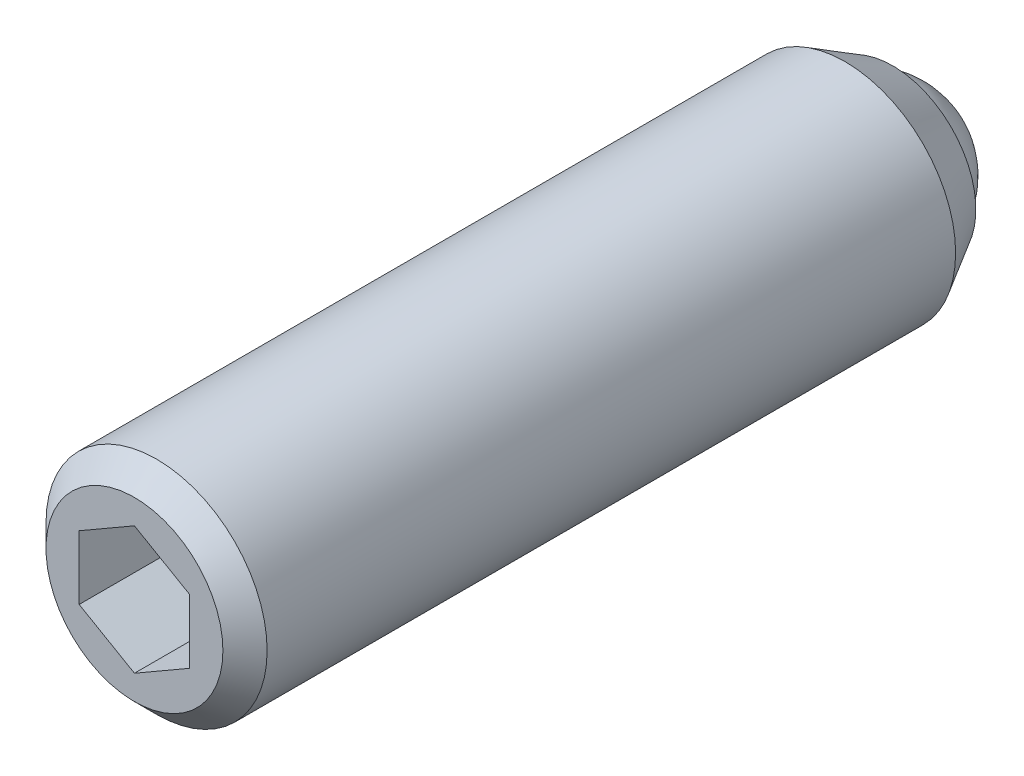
ISO-10303-21;
HEADER;
FILE_DESCRIPTION(('STEP AP214'),'2;1');
FILE_NAME('part.step','',(''),(''),'','','');
FILE_SCHEMA(('AUTOMOTIVE_DESIGN { 1 0 10303 214 1 1 1 1 }'));
ENDSEC;
DATA;
#1=APPLICATION_CONTEXT('core data for automotive mechanical design processes');
#2=APPLICATION_PROTOCOL_DEFINITION('international standard','automotive_design',2000,#1);
#3=PRODUCT_CONTEXT('',#1,'mechanical');
#4=PRODUCT('Part','Part','',(#3));
#5=PRODUCT_RELATED_PRODUCT_CATEGORY('part','',(#4));
#6=PRODUCT_DEFINITION_FORMATION('','',#4);
#7=PRODUCT_DEFINITION_CONTEXT('part definition',#1,'design');
#8=PRODUCT_DEFINITION('design','',#6,#7);
#9=PRODUCT_DEFINITION_SHAPE('','',#8);
#10=(LENGTH_UNIT() NAMED_UNIT(*) SI_UNIT(.MILLI.,.METRE.));
#11=(NAMED_UNIT(*) PLANE_ANGLE_UNIT() SI_UNIT($,.RADIAN.));
#12=(NAMED_UNIT(*) SI_UNIT($,.STERADIAN.) SOLID_ANGLE_UNIT());
#13=UNCERTAINTY_MEASURE_WITH_UNIT(LENGTH_MEASURE(1.E-05),#10,'distance_accuracy_value','');
#14=(GEOMETRIC_REPRESENTATION_CONTEXT(3) GLOBAL_UNCERTAINTY_ASSIGNED_CONTEXT((#13)) GLOBAL_UNIT_ASSIGNED_CONTEXT((#10,
#11,#12)) REPRESENTATION_CONTEXT('',''));
#15=CARTESIAN_POINT('',(0.,0.,0.));
#16=DIRECTION('',(0.,0.,1.));
#17=DIRECTION('',(1.,0.,0.));
#18=AXIS2_PLACEMENT_3D('',#15,#16,#17);
#19=CARTESIAN_POINT('',(2.5,1.44337567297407,34.2));
#20=DIRECTION('',(0.5,0.86602540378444,0.));
#21=DIRECTION('',(0.86602540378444,-0.5,0.));
#22=AXIS2_PLACEMENT_3D('',#19,#20,#21);
#23=PLANE('',#22);
#24=DIRECTION('',(0.,0.,1.));
#25=VECTOR('',#24,1.);
#26=CARTESIAN_POINT('',(2.5,1.44337567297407,34.2));
#27=LINE('',#26,#25);
#28=CARTESIAN_POINT('',(2.5,1.44337567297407,32.7));
#29=VERTEX_POINT('',#28);
#30=CARTESIAN_POINT('',(2.5,1.44337567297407,36.7));
#31=VERTEX_POINT('',#30);
#32=EDGE_CURVE('E68',#29,#31,#27,.T.);
#33=ORIENTED_EDGE('',*,*,#32,.T.);
#34=DIRECTION('',(-0.86602540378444,0.5,0.));
#35=VECTOR('',#34,1.);
#36=CARTESIAN_POINT('',(2.5,1.44337567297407,36.7));
#37=LINE('',#36,#35);
#38=CARTESIAN_POINT('',(0.,2.88675134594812,36.7));
#39=VERTEX_POINT('',#38);
#40=EDGE_CURVE('E29',#31,#39,#37,.T.);
#41=ORIENTED_EDGE('',*,*,#40,.T.);
#42=DIRECTION('',(0.,0.,1.));
#43=VECTOR('',#42,1.);
#44=CARTESIAN_POINT('',(0.,2.88675134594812,34.2));
#45=LINE('',#44,#43);
#46=CARTESIAN_POINT('',(0.,2.88675134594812,32.7));
#47=VERTEX_POINT('',#46);
#48=EDGE_CURVE('E80',#47,#39,#45,.T.);
#49=ORIENTED_EDGE('',*,*,#48,.F.);
#50=DIRECTION('',(-0.86602540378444,0.5,0.));
#51=VECTOR('',#50,1.);
#52=CARTESIAN_POINT('',(2.5,1.44337567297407,32.7));
#53=LINE('',#52,#51);
#54=EDGE_CURVE('E79',#29,#47,#53,.T.);
#55=ORIENTED_EDGE('',*,*,#54,.F.);
#56=EDGE_LOOP('',(#33,#41,#49,#55));
#57=FACE_BOUND('',#56,.T.);
#58=ADVANCED_FACE('F14',(#57),#23,.F.);
#59=CARTESIAN_POINT('',(2.5,-1.44337567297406,34.2));
#60=DIRECTION('',(1.,0.,0.));
#61=DIRECTION('',(0.,-1.,0.));
#62=AXIS2_PLACEMENT_3D('',#59,#60,#61);
#63=PLANE('',#62);
#64=DIRECTION('',(0.,0.,1.));
#65=VECTOR('',#64,1.);
#66=CARTESIAN_POINT('',(2.5,-1.44337567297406,34.2));
#67=LINE('',#66,#65);
#68=CARTESIAN_POINT('',(2.5,-1.44337567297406,32.7));
#69=VERTEX_POINT('',#68);
#70=CARTESIAN_POINT('',(2.5,-1.44337567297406,36.7));
#71=VERTEX_POINT('',#70);
#72=EDGE_CURVE('E76',#69,#71,#67,.T.);
#73=ORIENTED_EDGE('',*,*,#72,.T.);
#74=DIRECTION('',(0.,1.,0.));
#75=VECTOR('',#74,1.);
#76=CARTESIAN_POINT('',(2.5,-1.44337567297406,36.7));
#77=LINE('',#76,#75);
#78=EDGE_CURVE('E75',#71,#31,#77,.T.);
#79=ORIENTED_EDGE('',*,*,#78,.T.);
#80=ORIENTED_EDGE('',*,*,#32,.F.);
#81=DIRECTION('',(0.,1.,0.));
#82=VECTOR('',#81,1.);
#83=CARTESIAN_POINT('',(2.5,-1.44337567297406,32.7));
#84=LINE('',#83,#82);
#85=EDGE_CURVE('E72',#69,#29,#84,.T.);
#86=ORIENTED_EDGE('',*,*,#85,.F.);
#87=EDGE_LOOP('',(#73,#79,#80,#86));
#88=FACE_BOUND('',#87,.T.);
#89=ADVANCED_FACE('F70',(#88),#63,.F.);
#90=CARTESIAN_POINT('',(2.5,-1.44337567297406,34.2));
#91=DIRECTION('',(-0.5,0.866025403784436,0.));
#92=DIRECTION('',(0.866025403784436,0.5,0.));
#93=AXIS2_PLACEMENT_3D('',#90,#91,#92);
#94=PLANE('',#93);
#95=DIRECTION('',(0.,0.,1.));
#96=VECTOR('',#95,1.);
#97=CARTESIAN_POINT('',(0.,-2.88675134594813,34.2));
#98=LINE('',#97,#96);
#99=CARTESIAN_POINT('',(0.,-2.88675134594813,32.7));
#100=VERTEX_POINT('',#99);
#101=CARTESIAN_POINT('',(0.,-2.88675134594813,36.7));
#102=VERTEX_POINT('',#101);
#103=EDGE_CURVE('E122',#100,#102,#98,.T.);
#104=ORIENTED_EDGE('',*,*,#103,.T.);
#105=DIRECTION('',(-0.866025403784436,-0.5,0.));
#106=VECTOR('',#105,1.);
#107=CARTESIAN_POINT('',(2.5,-1.44337567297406,36.7));
#108=LINE('',#107,#106);
#109=EDGE_CURVE('E113',#71,#102,#108,.T.);
#110=ORIENTED_EDGE('',*,*,#109,.F.);
#111=ORIENTED_EDGE('',*,*,#72,.F.);
#112=DIRECTION('',(0.866025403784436,0.5,0.));
#113=VECTOR('',#112,1.);
#114=CARTESIAN_POINT('',(0.,-2.88675134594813,32.7));
#115=LINE('',#114,#113);
#116=EDGE_CURVE('E89',#100,#69,#115,.T.);
#117=ORIENTED_EDGE('',*,*,#116,.F.);
#118=EDGE_LOOP('',(#104,#110,#111,#117));
#119=FACE_BOUND('',#118,.T.);
#120=ADVANCED_FACE('F147',(#119),#94,.T.);
#121=CARTESIAN_POINT('',(-2.5,-1.44337567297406,34.2));
#122=DIRECTION('',(-0.5,-0.866025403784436,0.));
#123=DIRECTION('',(-0.866025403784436,0.5,0.));
#124=AXIS2_PLACEMENT_3D('',#121,#122,#123);
#125=PLANE('',#124);
#126=DIRECTION('',(0.,0.,1.));
#127=VECTOR('',#126,1.);
#128=CARTESIAN_POINT('',(-2.5,-1.44337567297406,34.2));
#129=LINE('',#128,#127);
#130=CARTESIAN_POINT('',(-2.5,-1.44337567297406,32.7));
#131=VERTEX_POINT('',#130);
#132=CARTESIAN_POINT('',(-2.5,-1.44337567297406,36.7));
#133=VERTEX_POINT('',#132);
#134=EDGE_CURVE('E120',#131,#133,#129,.T.);
#135=ORIENTED_EDGE('',*,*,#134,.T.);
#136=DIRECTION('',(0.866025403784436,-0.5,0.));
#137=VECTOR('',#136,1.);
#138=CARTESIAN_POINT('',(-2.5,-1.44337567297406,36.7));
#139=LINE('',#138,#137);
#140=EDGE_CURVE('E111',#133,#102,#139,.T.);
#141=ORIENTED_EDGE('',*,*,#140,.T.);
#142=ORIENTED_EDGE('',*,*,#103,.F.);
#143=DIRECTION('',(0.866025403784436,-0.5,0.));
#144=VECTOR('',#143,1.);
#145=CARTESIAN_POINT('',(-2.5,-1.44337567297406,32.7));
#146=LINE('',#145,#144);
#147=EDGE_CURVE('E101',#131,#100,#146,.T.);
#148=ORIENTED_EDGE('',*,*,#147,.F.);
#149=EDGE_LOOP('',(#135,#141,#142,#148));
#150=FACE_BOUND('',#149,.T.);
#151=ADVANCED_FACE('F157',(#150),#125,.F.);
#152=CARTESIAN_POINT('',(-2.5,-1.44337567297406,34.2));
#153=DIRECTION('',(1.,0.,0.));
#154=DIRECTION('',(0.,-1.,0.));
#155=AXIS2_PLACEMENT_3D('',#152,#153,#154);
#156=PLANE('',#155);
#157=DIRECTION('',(0.,0.,1.));
#158=VECTOR('',#157,1.);
#159=CARTESIAN_POINT('',(-2.5,1.44337567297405,34.2));
#160=LINE('',#159,#158);
#161=CARTESIAN_POINT('',(-2.5,1.44337567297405,32.7));
#162=VERTEX_POINT('',#161);
#163=CARTESIAN_POINT('',(-2.5,1.44337567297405,36.7));
#164=VERTEX_POINT('',#163);
#165=EDGE_CURVE('E37',#162,#164,#160,.T.);
#166=ORIENTED_EDGE('',*,*,#165,.T.);
#167=DIRECTION('',(0.,1.,0.));
#168=VECTOR('',#167,1.);
#169=CARTESIAN_POINT('',(-2.5,-1.44337567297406,36.7));
#170=LINE('',#169,#168);
#171=EDGE_CURVE('E108',#133,#164,#170,.T.);
#172=ORIENTED_EDGE('',*,*,#171,.F.);
#173=ORIENTED_EDGE('',*,*,#134,.F.);
#174=DIRECTION('',(0.,-1.,0.));
#175=VECTOR('',#174,1.);
#176=CARTESIAN_POINT('',(-2.5,1.44337567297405,32.7));
#177=LINE('',#176,#175);
#178=EDGE_CURVE('E98',#162,#131,#177,.T.);
#179=ORIENTED_EDGE('',*,*,#178,.F.);
#180=EDGE_LOOP('',(#166,#172,#173,#179));
#181=FACE_BOUND('',#180,.T.);
#182=ADVANCED_FACE('F153',(#181),#156,.T.);
#183=CARTESIAN_POINT('',(-2.5,1.44337567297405,34.2));
#184=DIRECTION('',(0.5,-0.866025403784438,0.));
#185=DIRECTION('',(-0.866025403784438,-0.5,0.));
#186=AXIS2_PLACEMENT_3D('',#183,#184,#185);
#187=PLANE('',#186);
#188=ORIENTED_EDGE('',*,*,#165,.F.);
#189=DIRECTION('',(-0.866025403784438,-0.5,0.));
#190=VECTOR('',#189,1.);
#191=CARTESIAN_POINT('',(0.,2.88675134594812,32.7));
#192=LINE('',#191,#190);
#193=EDGE_CURVE('E84',#47,#162,#192,.T.);
#194=ORIENTED_EDGE('',*,*,#193,.F.);
#195=ORIENTED_EDGE('',*,*,#48,.T.);
#196=DIRECTION('',(0.866025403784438,0.5,0.));
#197=VECTOR('',#196,1.);
#198=CARTESIAN_POINT('',(-2.5,1.44337567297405,36.7));
#199=LINE('',#198,#197);
#200=EDGE_CURVE('E105',#164,#39,#199,.T.);
#201=ORIENTED_EDGE('',*,*,#200,.F.);
#202=EDGE_LOOP('',(#188,#194,#195,#201));
#203=FACE_BOUND('',#202,.T.);
#204=ADVANCED_FACE('F150',(#203),#187,.T.);
#205=CARTESIAN_POINT('',(0.,0.,36.45));
#206=DIRECTION('',(0.,0.,-1.));
#207=DIRECTION('',(1.,0.,0.));
#208=AXIS2_PLACEMENT_3D('',#205,#206,#207);
#209=CYLINDRICAL_SURFACE('',#208,5.);
#210=CARTESIAN_POINT('',(0.,0.,35.7));
#211=DIRECTION('',(0.,0.,-1.));
#212=DIRECTION('',(1.,0.,0.));
#213=AXIS2_PLACEMENT_3D('',#210,#211,#212);
#214=CIRCLE('',#213,5.);
#215=CARTESIAN_POINT('',(5.,0.,35.7));
#216=VERTEX_POINT('',#215);
#217=EDGE_CURVE('E9',#216,#216,#214,.T.);
#218=ORIENTED_EDGE('',*,*,#217,.T.);
#219=EDGE_LOOP('',(#218));
#220=FACE_BOUND('',#219,.T.);
#221=CARTESIAN_POINT('',(0.,0.,4.56506350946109));
#222=DIRECTION('',(0.,0.,-1.));
#223=DIRECTION('',(-1.,0.,0.));
#224=AXIS2_PLACEMENT_3D('',#221,#222,#223);
#225=CIRCLE('',#224,5.);
#226=CARTESIAN_POINT('',(-5.,0.,4.56506350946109));
#227=VERTEX_POINT('',#226);
#228=EDGE_CURVE('E244',#227,#227,#225,.T.);
#229=ORIENTED_EDGE('',*,*,#228,.F.);
#230=EDGE_LOOP('',(#229));
#231=FACE_BOUND('',#230,.T.);
#232=ADVANCED_FACE('F16',(#220,#231),#209,.T.);
#233=CARTESIAN_POINT('',(0.,0.,35.7));
#234=DIRECTION('',(0.,0.,-1.));
#235=DIRECTION('',(1.,0.,0.));
#236=AXIS2_PLACEMENT_3D('',#233,#234,#235);
#237=CONICAL_SURFACE('',#236,5.,0.785398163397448);
#238=CARTESIAN_POINT('',(0.,0.,36.7));
#239=DIRECTION('',(0.,0.,-1.));
#240=DIRECTION('',(1.,0.,0.));
#241=AXIS2_PLACEMENT_3D('',#238,#239,#240);
#242=CIRCLE('',#241,4.);
#243=CARTESIAN_POINT('',(4.,0.,36.7));
#244=VERTEX_POINT('',#243);
#245=EDGE_CURVE('E22',#244,#244,#242,.T.);
#246=ORIENTED_EDGE('',*,*,#245,.T.);
#247=EDGE_LOOP('',(#246));
#248=FACE_BOUND('',#247,.T.);
#249=ORIENTED_EDGE('',*,*,#217,.F.);
#250=EDGE_LOOP('',(#249));
#251=FACE_BOUND('',#250,.T.);
#252=ADVANCED_FACE('F127',(#248,#251),#237,.T.);
#253=CARTESIAN_POINT('',(0.,0.,36.7));
#254=DIRECTION('',(0.,0.,-1.));
#255=DIRECTION('',(1.,0.,0.));
#256=AXIS2_PLACEMENT_3D('',#253,#254,#255);
#257=PLANE('',#256);
#258=ORIENTED_EDGE('',*,*,#200,.T.);
#259=ORIENTED_EDGE('',*,*,#40,.F.);
#260=ORIENTED_EDGE('',*,*,#78,.F.);
#261=ORIENTED_EDGE('',*,*,#109,.T.);
#262=ORIENTED_EDGE('',*,*,#140,.F.);
#263=ORIENTED_EDGE('',*,*,#171,.T.);
#264=EDGE_LOOP('',(#258,#259,#260,#261,#262,#263));
#265=FACE_BOUND('',#264,.T.);
#266=ORIENTED_EDGE('',*,*,#245,.F.);
#267=EDGE_LOOP('',(#266));
#268=FACE_BOUND('',#267,.T.);
#269=ADVANCED_FACE('F130',(#265,#268),#257,.F.);
#270=CARTESIAN_POINT('',(2.5,1.44337567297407,32.7));
#271=DIRECTION('',(0.,0.,1.));
#272=DIRECTION('',(1.,0.,0.));
#273=AXIS2_PLACEMENT_3D('',#270,#271,#272);
#274=PLANE('',#273);
#275=ORIENTED_EDGE('',*,*,#85,.T.);
#276=ORIENTED_EDGE('',*,*,#54,.T.);
#277=ORIENTED_EDGE('',*,*,#193,.T.);
#278=ORIENTED_EDGE('',*,*,#178,.T.);
#279=ORIENTED_EDGE('',*,*,#147,.T.);
#280=ORIENTED_EDGE('',*,*,#116,.T.);
#281=EDGE_LOOP('',(#275,#276,#277,#278,#279,#280));
#282=FACE_BOUND('',#281,.T.);
#283=ADVANCED_FACE('F86',(#282),#274,.T.);
#284=CARTESIAN_POINT('',(0.,0.,3.5));
#285=DIRECTION('',(0.,0.,-1.));
#286=DIRECTION('',(-1.,0.,0.));
#287=AXIS2_PLACEMENT_3D('',#284,#285,#286);
#288=SPHERICAL_SURFACE('',#287,3.5);
#289=CARTESIAN_POINT('',(0.,0.,2.4));
#290=DIRECTION('',(0.,0.,-1.));
#291=DIRECTION('',(-1.,0.,0.));
#292=AXIS2_PLACEMENT_3D('',#289,#290,#291);
#293=CIRCLE('',#292,3.32264954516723);
#294=CARTESIAN_POINT('',(-3.32264954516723,0.,2.4));
#295=VERTEX_POINT('',#294);
#296=EDGE_CURVE('E90',#295,#295,#293,.T.);
#297=ORIENTED_EDGE('',*,*,#296,.T.);
#298=EDGE_LOOP('',(#297));
#299=FACE_BOUND('',#298,.T.);
#300=ADVANCED_FACE('F139',(#299),#288,.T.);
#301=CARTESIAN_POINT('',(-3.32264954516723,0.,2.4));
#302=DIRECTION('',(0.,0.,-1.));
#303=DIRECTION('',(-1.,0.,0.));
#304=AXIS2_PLACEMENT_3D('',#301,#302,#303);
#305=PLANE('',#304);
#306=CARTESIAN_POINT('',(0.,0.,2.4));
#307=DIRECTION('',(0.,0.,-1.));
#308=DIRECTION('',(-1.,0.,0.));
#309=AXIS2_PLACEMENT_3D('',#306,#307,#308);
#310=CIRCLE('',#309,3.75);
#311=CARTESIAN_POINT('',(-3.75,0.,2.4));
#312=VERTEX_POINT('',#311);
#313=EDGE_CURVE('E93',#312,#312,#310,.T.);
#314=ORIENTED_EDGE('',*,*,#313,.T.);
#315=EDGE_LOOP('',(#314));
#316=FACE_BOUND('',#315,.T.);
#317=ORIENTED_EDGE('',*,*,#296,.F.);
#318=EDGE_LOOP('',(#317));
#319=FACE_BOUND('',#318,.T.);
#320=ADVANCED_FACE('F216',(#316,#319),#305,.T.);
#321=CARTESIAN_POINT('',(0.,0.,2.4));
#322=DIRECTION('',(0.,0.,1.));
#323=DIRECTION('',(1.,0.,0.));
#324=AXIS2_PLACEMENT_3D('',#321,#322,#323);
#325=CONICAL_SURFACE('',#324,3.75,0.523598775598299);
#326=ORIENTED_EDGE('',*,*,#228,.T.);
#327=EDGE_LOOP('',(#326));
#328=FACE_BOUND('',#327,.T.);
#329=ORIENTED_EDGE('',*,*,#313,.F.);
#330=EDGE_LOOP('',(#329));
#331=FACE_BOUND('',#330,.T.);
#332=ADVANCED_FACE('F225',(#328,#331),#325,.T.);
#333=CLOSED_SHELL('',(#58,#89,#120,#151,#182,#204,#232,#252,#269,#283,#300,#320,#332));
#334=MANIFOLD_SOLID_BREP('B1',#333);
#335=ADVANCED_BREP_SHAPE_REPRESENTATION('',(#18,#334),#14);
#336=SHAPE_DEFINITION_REPRESENTATION(#9,#335);
ENDSEC;
END-ISO-10303-21;
